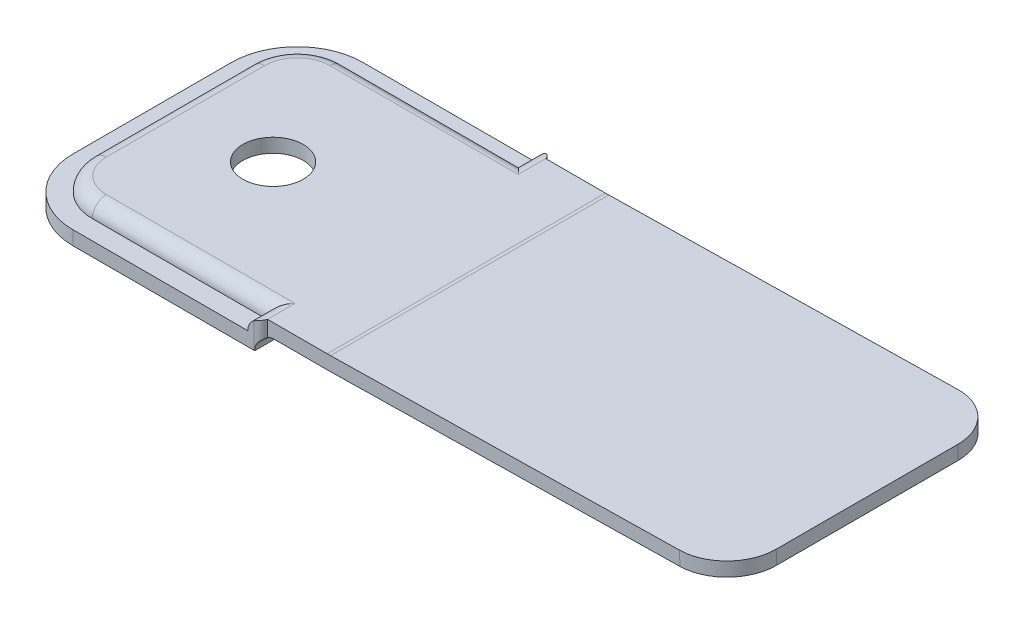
ISO-10303-21;
HEADER;
FILE_DESCRIPTION(('STEP AP214'),'2;1');
FILE_NAME('part.step','',(''),(''),'','','');
FILE_SCHEMA(('AUTOMOTIVE_DESIGN { 1 0 10303 214 1 1 1 1 }'));
ENDSEC;
DATA;
#1=APPLICATION_CONTEXT('core data for automotive mechanical design processes');
#2=APPLICATION_PROTOCOL_DEFINITION('international standard','automotive_design',2000,#1);
#3=PRODUCT_CONTEXT('',#1,'mechanical');
#4=PRODUCT('Part','Part','',(#3));
#5=PRODUCT_RELATED_PRODUCT_CATEGORY('part','',(#4));
#6=PRODUCT_DEFINITION_FORMATION('','',#4);
#7=PRODUCT_DEFINITION_CONTEXT('part definition',#1,'design');
#8=PRODUCT_DEFINITION('design','',#6,#7);
#9=PRODUCT_DEFINITION_SHAPE('','',#8);
#10=(LENGTH_UNIT() NAMED_UNIT(*) SI_UNIT(.MILLI.,.METRE.));
#11=(NAMED_UNIT(*) PLANE_ANGLE_UNIT() SI_UNIT($,.RADIAN.));
#12=(NAMED_UNIT(*) SI_UNIT($,.STERADIAN.) SOLID_ANGLE_UNIT());
#13=UNCERTAINTY_MEASURE_WITH_UNIT(LENGTH_MEASURE(1.E-05),#10,'distance_accuracy_value','');
#14=(GEOMETRIC_REPRESENTATION_CONTEXT(3) GLOBAL_UNCERTAINTY_ASSIGNED_CONTEXT((#13)) GLOBAL_UNIT_ASSIGNED_CONTEXT((#10,
#11,#12)) REPRESENTATION_CONTEXT('',''));
#15=CARTESIAN_POINT('',(0.,0.,0.));
#16=DIRECTION('',(0.,0.,1.));
#17=DIRECTION('',(1.,0.,0.));
#18=AXIS2_PLACEMENT_3D('',#15,#16,#17);
#19=CARTESIAN_POINT('',(-3.6195,0.9144,5.207));
#20=DIRECTION('',(0.,-1.,0.));
#21=DIRECTION('',(0.,0.,-1.));
#22=AXIS2_PLACEMENT_3D('',#19,#20,#21);
#23=PLANE('',#22);
#24=DIRECTION('',(0.,0.,1.));
#25=VECTOR('',#24,1.);
#26=CARTESIAN_POINT('',(7.8613,0.9144,-9.525));
#27=LINE('',#26,#25);
#28=CARTESIAN_POINT('',(7.8613,0.9144,-9.525));
#29=VERTEX_POINT('',#28);
#30=CARTESIAN_POINT('',(7.8613,0.9144,-8.255));
#31=VERTEX_POINT('',#30);
#32=EDGE_CURVE('E303',#29,#31,#27,.T.);
#33=ORIENTED_EDGE('',*,*,#32,.F.);
#34=DIRECTION('',(-1.,0.,0.));
#35=VECTOR('',#34,1.);
#36=CARTESIAN_POINT('',(8.3185,0.9144,-9.525));
#37=LINE('',#36,#35);
#38=CARTESIAN_POINT('',(-3.61949999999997,0.9144,-9.525));
#39=VERTEX_POINT('',#38);
#40=EDGE_CURVE('E338',#29,#39,#37,.T.);
#41=ORIENTED_EDGE('',*,*,#40,.T.);
#42=CARTESIAN_POINT('',(-3.6195,0.9144,-5.207));
#43=DIRECTION('',(0.,1.,0.));
#44=DIRECTION('',(0.,0.,1.));
#45=AXIS2_PLACEMENT_3D('',#42,#43,#44);
#46=CIRCLE('',#45,4.318);
#47=CARTESIAN_POINT('',(-7.9375,0.9144,-5.20699999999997));
#48=VERTEX_POINT('',#47);
#49=EDGE_CURVE('E922',#39,#48,#46,.T.);
#50=ORIENTED_EDGE('',*,*,#49,.T.);
#51=DIRECTION('',(0.,0.,1.));
#52=VECTOR('',#51,1.);
#53=CARTESIAN_POINT('',(-7.9375,0.9144,-5.20699999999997));
#54=LINE('',#53,#52);
#55=CARTESIAN_POINT('',(-7.9375,0.9144,5.20699999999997));
#56=VERTEX_POINT('',#55);
#57=EDGE_CURVE('E933',#48,#56,#54,.T.);
#58=ORIENTED_EDGE('',*,*,#57,.T.);
#59=CARTESIAN_POINT('',(-3.6195,0.9144,5.207));
#60=DIRECTION('',(0.,1.,0.));
#61=DIRECTION('',(0.,0.,-1.));
#62=AXIS2_PLACEMENT_3D('',#59,#60,#61);
#63=CIRCLE('',#62,4.318);
#64=CARTESIAN_POINT('',(-3.61949999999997,0.9144,9.525));
#65=VERTEX_POINT('',#64);
#66=EDGE_CURVE('E930',#56,#65,#63,.T.);
#67=ORIENTED_EDGE('',*,*,#66,.T.);
#68=DIRECTION('',(1.,0.,0.));
#69=VECTOR('',#68,1.);
#70=CARTESIAN_POINT('',(8.3185,0.9144,9.525));
#71=LINE('',#70,#69);
#72=CARTESIAN_POINT('',(7.8613,0.9144,9.525));
#73=VERTEX_POINT('',#72);
#74=EDGE_CURVE('E900',#65,#73,#71,.T.);
#75=ORIENTED_EDGE('',*,*,#74,.T.);
#76=CARTESIAN_POINT('',(7.8613,0.9144,8.255));
#77=VERTEX_POINT('',#76);
#78=EDGE_CURVE('E293',#77,#73,#27,.T.);
#79=ORIENTED_EDGE('',*,*,#78,.F.);
#80=DIRECTION('',(1.,0.,0.));
#81=VECTOR('',#80,1.);
#82=CARTESIAN_POINT('',(8.3185,0.9144,8.255));
#83=LINE('',#82,#81);
#84=CARTESIAN_POINT('',(-3.6195,0.9144,8.255));
#85=VERTEX_POINT('',#84);
#86=EDGE_CURVE('E335',#85,#77,#83,.T.);
#87=ORIENTED_EDGE('',*,*,#86,.F.);
#88=CARTESIAN_POINT('',(-3.6195,0.9144,5.207));
#89=DIRECTION('',(0.,1.,0.));
#90=DIRECTION('',(0.,0.,-1.));
#91=AXIS2_PLACEMENT_3D('',#88,#89,#90);
#92=CIRCLE('',#91,3.048);
#93=CARTESIAN_POINT('',(-6.6675,0.9144,5.207));
#94=VERTEX_POINT('',#93);
#95=EDGE_CURVE('E332',#94,#85,#92,.T.);
#96=ORIENTED_EDGE('',*,*,#95,.F.);
#97=DIRECTION('',(0.,0.,1.));
#98=VECTOR('',#97,1.);
#99=CARTESIAN_POINT('',(-6.6675,0.9144,5.207));
#100=LINE('',#99,#98);
#101=CARTESIAN_POINT('',(-6.6675,0.9144,-5.207));
#102=VERTEX_POINT('',#101);
#103=EDGE_CURVE('E329',#102,#94,#100,.T.);
#104=ORIENTED_EDGE('',*,*,#103,.F.);
#105=CARTESIAN_POINT('',(-3.6195,0.9144,-5.207));
#106=DIRECTION('',(0.,1.,0.));
#107=DIRECTION('',(0.,0.,-1.));
#108=AXIS2_PLACEMENT_3D('',#105,#106,#107);
#109=CIRCLE('',#108,3.048);
#110=CARTESIAN_POINT('',(-3.6195,0.9144,-8.255));
#111=VERTEX_POINT('',#110);
#112=EDGE_CURVE('E326',#111,#102,#109,.T.);
#113=ORIENTED_EDGE('',*,*,#112,.F.);
#114=DIRECTION('',(-1.,0.,0.));
#115=VECTOR('',#114,1.);
#116=CARTESIAN_POINT('',(8.3185,0.9144,-8.255));
#117=LINE('',#116,#115);
#118=EDGE_CURVE('E325',#31,#111,#117,.T.);
#119=ORIENTED_EDGE('',*,*,#118,.F.);
#120=EDGE_LOOP('',(#33,#41,#50,#58,#67,#75,#79,#87,#96,#104,#113,#119));
#121=FACE_BOUND('',#120,.T.);
#122=ADVANCED_FACE('F35',(#121),#23,.F.);
#123=CARTESIAN_POINT('',(-3.6195,0.,5.207));
#124=DIRECTION('',(0.,-1.,0.));
#125=DIRECTION('',(0.,0.,-1.));
#126=AXIS2_PLACEMENT_3D('',#123,#124,#125);
#127=PLANE('',#126);
#128=DIRECTION('',(0.,0.,-1.));
#129=VECTOR('',#128,1.);
#130=CARTESIAN_POINT('',(8.3185,0.,-9.525));
#131=LINE('',#130,#129);
#132=CARTESIAN_POINT('',(8.3185,0.,9.52381561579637));
#133=VERTEX_POINT('',#132);
#134=CARTESIAN_POINT('',(8.3185,0.,7.34059999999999));
#135=VERTEX_POINT('',#134);
#136=EDGE_CURVE('E561',#133,#135,#131,.T.);
#137=ORIENTED_EDGE('',*,*,#136,.F.);
#138=CARTESIAN_POINT('',(8.28383111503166,0.,9.017));
#139=DIRECTION('',(0.,-1.,0.));
#140=DIRECTION('',(0.,0.,-1.));
#141=AXIS2_PLACEMENT_3D('',#138,#139,#140);
#142=CIRCLE('',#141,0.508);
#143=CARTESIAN_POINT('',(8.28383111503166,0.,9.525));
#144=VERTEX_POINT('',#143);
#145=EDGE_CURVE('E546',#133,#144,#142,.T.);
#146=ORIENTED_EDGE('',*,*,#145,.T.);
#147=DIRECTION('',(1.,0.,0.));
#148=VECTOR('',#147,1.);
#149=CARTESIAN_POINT('',(8.3185,0.,9.525));
#150=LINE('',#149,#148);
#151=CARTESIAN_POINT('',(-3.61949999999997,0.,9.525));
#152=VERTEX_POINT('',#151);
#153=EDGE_CURVE('E908',#152,#144,#150,.T.);
#154=ORIENTED_EDGE('',*,*,#153,.F.);
#155=CARTESIAN_POINT('',(-3.6195,0.,5.207));
#156=DIRECTION('',(0.,1.,0.));
#157=DIRECTION('',(0.,0.,-1.));
#158=AXIS2_PLACEMENT_3D('',#155,#156,#157);
#159=CIRCLE('',#158,4.318);
#160=CARTESIAN_POINT('',(-7.9375,0.,5.20699999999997));
#161=VERTEX_POINT('',#160);
#162=EDGE_CURVE('E906',#161,#152,#159,.T.);
#163=ORIENTED_EDGE('',*,*,#162,.F.);
#164=DIRECTION('',(0.,0.,1.));
#165=VECTOR('',#164,1.);
#166=CARTESIAN_POINT('',(-7.9375,0.,-5.20699999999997));
#167=LINE('',#166,#165);
#168=CARTESIAN_POINT('',(-7.9375,0.,-5.20699999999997));
#169=VERTEX_POINT('',#168);
#170=EDGE_CURVE('E904',#169,#161,#167,.T.);
#171=ORIENTED_EDGE('',*,*,#170,.F.);
#172=CARTESIAN_POINT('',(-3.6195,0.,-5.207));
#173=DIRECTION('',(0.,1.,0.));
#174=DIRECTION('',(0.,0.,1.));
#175=AXIS2_PLACEMENT_3D('',#172,#173,#174);
#176=CIRCLE('',#175,4.318);
#177=CARTESIAN_POINT('',(-3.61949999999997,0.,-9.525));
#178=VERTEX_POINT('',#177);
#179=EDGE_CURVE('E897',#178,#169,#176,.T.);
#180=ORIENTED_EDGE('',*,*,#179,.F.);
#181=DIRECTION('',(-1.,0.,0.));
#182=VECTOR('',#181,1.);
#183=CARTESIAN_POINT('',(8.3185,0.,-9.525));
#184=LINE('',#183,#182);
#185=CARTESIAN_POINT('',(8.28383111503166,0.,-9.525));
#186=VERTEX_POINT('',#185);
#187=EDGE_CURVE('E554',#186,#178,#184,.T.);
#188=ORIENTED_EDGE('',*,*,#187,.F.);
#189=CARTESIAN_POINT('',(8.28383111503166,0.,-9.017));
#190=DIRECTION('',(0.,-1.,0.));
#191=DIRECTION('',(0.,0.,-1.));
#192=AXIS2_PLACEMENT_3D('',#189,#190,#191);
#193=CIRCLE('',#192,0.508);
#194=CARTESIAN_POINT('',(8.3185,0.,-9.52381561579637));
#195=VERTEX_POINT('',#194);
#196=EDGE_CURVE('E436',#186,#195,#193,.T.);
#197=ORIENTED_EDGE('',*,*,#196,.T.);
#198=CARTESIAN_POINT('',(8.3185,0.,-7.3406));
#199=VERTEX_POINT('',#198);
#200=EDGE_CURVE('E344',#199,#195,#131,.T.);
#201=ORIENTED_EDGE('',*,*,#200,.F.);
#202=DIRECTION('',(1.,0.,0.));
#203=VECTOR('',#202,1.);
#204=CARTESIAN_POINT('',(8.3185,0.,-7.3406));
#205=LINE('',#204,#203);
#206=CARTESIAN_POINT('',(-3.6195,0.,-7.3406));
#207=VERTEX_POINT('',#206);
#208=EDGE_CURVE('E315',#207,#199,#205,.T.);
#209=ORIENTED_EDGE('',*,*,#208,.F.);
#210=CARTESIAN_POINT('',(-3.6195,0.,-5.207));
#211=DIRECTION('',(0.,-1.,0.));
#212=DIRECTION('',(0.,0.,-1.));
#213=AXIS2_PLACEMENT_3D('',#210,#211,#212);
#214=CIRCLE('',#213,2.1336);
#215=CARTESIAN_POINT('',(-5.7531,0.,-5.207));
#216=VERTEX_POINT('',#215);
#217=EDGE_CURVE('E312',#216,#207,#214,.T.);
#218=ORIENTED_EDGE('',*,*,#217,.F.);
#219=DIRECTION('',(0.,0.,-1.));
#220=VECTOR('',#219,1.);
#221=CARTESIAN_POINT('',(-5.7531,0.,-5.207));
#222=LINE('',#221,#220);
#223=CARTESIAN_POINT('',(-5.7531,0.,5.207));
#224=VERTEX_POINT('',#223);
#225=EDGE_CURVE('E309',#224,#216,#222,.T.);
#226=ORIENTED_EDGE('',*,*,#225,.F.);
#227=CARTESIAN_POINT('',(-3.6195,0.,5.207));
#228=DIRECTION('',(0.,-1.,0.));
#229=DIRECTION('',(0.,0.,1.));
#230=AXIS2_PLACEMENT_3D('',#227,#228,#229);
#231=CIRCLE('',#230,2.1336);
#232=CARTESIAN_POINT('',(-3.6195,0.,7.34059999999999));
#233=VERTEX_POINT('',#232);
#234=EDGE_CURVE('E306',#233,#224,#231,.T.);
#235=ORIENTED_EDGE('',*,*,#234,.F.);
#236=DIRECTION('',(-1.,0.,0.));
#237=VECTOR('',#236,1.);
#238=CARTESIAN_POINT('',(-3.6195,0.,7.34059999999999));
#239=LINE('',#238,#237);
#240=EDGE_CURVE('E318',#135,#233,#239,.T.);
#241=ORIENTED_EDGE('',*,*,#240,.F.);
#242=EDGE_LOOP('',(#137,#146,#154,#163,#171,#180,#188,#197,#201,#209,#218,#226,#235,#241));
#243=FACE_BOUND('',#242,.T.);
#244=ADVANCED_FACE('F498',(#243),#127,.T.);
#245=CARTESIAN_POINT('',(8.3185,0.9144,-9.525));
#246=DIRECTION('',(0.,0.,1.));
#247=DIRECTION('',(1.,0.,0.));
#248=AXIS2_PLACEMENT_3D('',#245,#246,#247);
#249=PLANE('',#248);
#250=CARTESIAN_POINT('',(8.7757,0.9144,-9.525));
#251=DIRECTION('',(0.,0.,1.));
#252=DIRECTION('',(1.,0.,0.));
#253=AXIS2_PLACEMENT_3D('',#250,#251,#252);
#254=CIRCLE('',#253,0.9144);
#255=CARTESIAN_POINT('',(8.28383111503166,1.68523873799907,-9.525));
#256=VERTEX_POINT('',#255);
#257=EDGE_CURVE('E389',#29,#256,#254,.F.);
#258=ORIENTED_EDGE('',*,*,#257,.T.);
#259=DIRECTION('',(0.,1.,0.));
#260=VECTOR('',#259,1.);
#261=CARTESIAN_POINT('',(8.28383111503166,0.9144,-9.525));
#262=LINE('',#261,#260);
#263=EDGE_CURVE('E478',#256,#186,#262,.F.);
#264=ORIENTED_EDGE('',*,*,#263,.T.);
#265=ORIENTED_EDGE('',*,*,#187,.T.);
#266=DIRECTION('',(0.,-1.,0.));
#267=VECTOR('',#266,1.);
#268=CARTESIAN_POINT('',(-3.61949999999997,0.9144,-9.525));
#269=LINE('',#268,#267);
#270=EDGE_CURVE('E354',#39,#178,#269,.T.);
#271=ORIENTED_EDGE('',*,*,#270,.F.);
#272=ORIENTED_EDGE('',*,*,#40,.F.);
#273=EDGE_LOOP('',(#258,#264,#265,#271,#272));
#274=FACE_BOUND('',#273,.T.);
#275=ADVANCED_FACE('F504',(#274),#249,.F.);
#276=CARTESIAN_POINT('',(-3.6195,0.9144,-5.207));
#277=DIRECTION('',(0.,-1.,0.));
#278=DIRECTION('',(0.,0.,-1.));
#279=AXIS2_PLACEMENT_3D('',#276,#277,#278);
#280=CYLINDRICAL_SURFACE('',#279,4.318);
#281=ORIENTED_EDGE('',*,*,#179,.T.);
#282=DIRECTION('',(0.,-1.,0.));
#283=VECTOR('',#282,1.);
#284=CARTESIAN_POINT('',(-7.9375,0.9144,-5.20699999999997));
#285=LINE('',#284,#283);
#286=EDGE_CURVE('E916',#48,#169,#285,.T.);
#287=ORIENTED_EDGE('',*,*,#286,.F.);
#288=ORIENTED_EDGE('',*,*,#49,.F.);
#289=ORIENTED_EDGE('',*,*,#270,.T.);
#290=EDGE_LOOP('',(#281,#287,#288,#289));
#291=FACE_BOUND('',#290,.T.);
#292=ADVANCED_FACE('F522',(#291),#280,.T.);
#293=CARTESIAN_POINT('',(-7.9375,0.9144,-5.20699999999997));
#294=DIRECTION('',(1.,0.,0.));
#295=DIRECTION('',(0.,0.,-1.));
#296=AXIS2_PLACEMENT_3D('',#293,#294,#295);
#297=PLANE('',#296);
#298=ORIENTED_EDGE('',*,*,#170,.T.);
#299=DIRECTION('',(0.,-1.,0.));
#300=VECTOR('',#299,1.);
#301=CARTESIAN_POINT('',(-7.9375,0.9144,5.20699999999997));
#302=LINE('',#301,#300);
#303=EDGE_CURVE('E913',#56,#161,#302,.T.);
#304=ORIENTED_EDGE('',*,*,#303,.F.);
#305=ORIENTED_EDGE('',*,*,#57,.F.);
#306=ORIENTED_EDGE('',*,*,#286,.T.);
#307=EDGE_LOOP('',(#298,#304,#305,#306));
#308=FACE_BOUND('',#307,.T.);
#309=ADVANCED_FACE('F518',(#308),#297,.F.);
#310=CARTESIAN_POINT('',(-3.6195,0.9144,5.207));
#311=DIRECTION('',(0.,-1.,0.));
#312=DIRECTION('',(0.,0.,-1.));
#313=AXIS2_PLACEMENT_3D('',#310,#311,#312);
#314=CYLINDRICAL_SURFACE('',#313,4.318);
#315=ORIENTED_EDGE('',*,*,#162,.T.);
#316=DIRECTION('',(0.,-1.,0.));
#317=VECTOR('',#316,1.);
#318=CARTESIAN_POINT('',(-3.61949999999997,0.9144,9.525));
#319=LINE('',#318,#317);
#320=EDGE_CURVE('E910',#65,#152,#319,.T.);
#321=ORIENTED_EDGE('',*,*,#320,.F.);
#322=ORIENTED_EDGE('',*,*,#66,.F.);
#323=ORIENTED_EDGE('',*,*,#303,.T.);
#324=EDGE_LOOP('',(#315,#321,#322,#323));
#325=FACE_BOUND('',#324,.T.);
#326=ADVANCED_FACE('F514',(#325),#314,.T.);
#327=CARTESIAN_POINT('',(8.3185,0.9144,9.525));
#328=DIRECTION('',(0.,0.,-1.));
#329=DIRECTION('',(-1.,0.,0.));
#330=AXIS2_PLACEMENT_3D('',#327,#328,#329);
#331=PLANE('',#330);
#332=ORIENTED_EDGE('',*,*,#153,.T.);
#333=DIRECTION('',(0.,1.,0.));
#334=VECTOR('',#333,1.);
#335=CARTESIAN_POINT('',(8.28383111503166,0.9144,9.525));
#336=LINE('',#335,#334);
#337=CARTESIAN_POINT('',(8.28383111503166,1.68523873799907,9.525));
#338=VERTEX_POINT('',#337);
#339=EDGE_CURVE('E545',#144,#338,#336,.T.);
#340=ORIENTED_EDGE('',*,*,#339,.T.);
#341=CARTESIAN_POINT('',(8.7757,0.9144,9.525));
#342=DIRECTION('',(0.,0.,-1.));
#343=DIRECTION('',(-1.,0.,0.));
#344=AXIS2_PLACEMENT_3D('',#341,#342,#343);
#345=CIRCLE('',#344,0.9144);
#346=EDGE_CURVE('E387',#338,#73,#345,.F.);
#347=ORIENTED_EDGE('',*,*,#346,.T.);
#348=ORIENTED_EDGE('',*,*,#74,.F.);
#349=ORIENTED_EDGE('',*,*,#320,.T.);
#350=EDGE_LOOP('',(#332,#340,#347,#348,#349));
#351=FACE_BOUND('',#350,.T.);
#352=ADVANCED_FACE('F511',(#351),#331,.F.);
#353=CARTESIAN_POINT('',(0.,0.9144,0.));
#354=DIRECTION('',(0.,-1.,0.));
#355=DIRECTION('',(0.,0.,-1.));
#356=AXIS2_PLACEMENT_3D('',#353,#354,#355);
#357=CYLINDRICAL_SURFACE('',#356,1.984375);
#358=CARTESIAN_POINT('',(0.,0.9144,0.));
#359=DIRECTION('',(0.,1.,0.));
#360=DIRECTION('',(0.,0.,1.));
#361=AXIS2_PLACEMENT_3D('',#358,#359,#360);
#362=CIRCLE('',#361,1.984375);
#363=CARTESIAN_POINT('',(0.,0.9144,1.984375));
#364=VERTEX_POINT('',#363);
#365=EDGE_CURVE('E321',#364,#364,#362,.T.);
#366=ORIENTED_EDGE('',*,*,#365,.F.);
#367=EDGE_LOOP('',(#366));
#368=FACE_BOUND('',#367,.T.);
#369=CARTESIAN_POINT('',(0.,1.8288,0.));
#370=DIRECTION('',(0.,1.,0.));
#371=DIRECTION('',(0.,0.,1.));
#372=AXIS2_PLACEMENT_3D('',#369,#370,#371);
#373=CIRCLE('',#372,1.984375);
#374=CARTESIAN_POINT('',(0.,1.8288,1.984375));
#375=VERTEX_POINT('',#374);
#376=EDGE_CURVE('E322',#375,#375,#373,.T.);
#377=ORIENTED_EDGE('',*,*,#376,.T.);
#378=EDGE_LOOP('',(#377));
#379=FACE_BOUND('',#378,.T.);
#380=ADVANCED_FACE('F508',(#368,#379),#357,.F.);
#381=CARTESIAN_POINT('',(-3.6195,1.8288,-5.207));
#382=DIRECTION('',(0.,-1.,0.));
#383=DIRECTION('',(0.,0.,-1.));
#384=AXIS2_PLACEMENT_3D('',#381,#382,#383);
#385=PLANE('',#384);
#386=DIRECTION('',(1.,0.,0.));
#387=VECTOR('',#386,1.);
#388=CARTESIAN_POINT('',(-3.6195,1.8288,7.34059999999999));
#389=LINE('',#388,#387);
#390=CARTESIAN_POINT('',(-3.6195,1.8288,7.3406));
#391=VERTEX_POINT('',#390);
#392=CARTESIAN_POINT('',(8.7757,1.8288,7.3406));
#393=VERTEX_POINT('',#392);
#394=EDGE_CURVE('E367',#391,#393,#389,.T.);
#395=ORIENTED_EDGE('',*,*,#394,.T.);
#396=DIRECTION('',(0.,0.,1.));
#397=VECTOR('',#396,1.);
#398=CARTESIAN_POINT('',(8.7757,1.8288,-5.207));
#399=LINE('',#398,#397);
#400=CARTESIAN_POINT('',(8.7757,1.8288,9.144));
#401=VERTEX_POINT('',#400);
#402=EDGE_CURVE('E370',#393,#401,#399,.T.);
#403=ORIENTED_EDGE('',*,*,#402,.T.);
#404=DIRECTION('',(1.,0.,0.));
#405=VECTOR('',#404,1.);
#406=CARTESIAN_POINT('',(12.7,1.8288,9.144));
#407=LINE('',#406,#405);
#408=CARTESIAN_POINT('',(12.7,1.8288,9.144));
#409=VERTEX_POINT('',#408);
#410=EDGE_CURVE('E264',#401,#409,#407,.T.);
#411=ORIENTED_EDGE('',*,*,#410,.T.);
#412=DIRECTION('',(0.,0.,-1.));
#413=VECTOR('',#412,1.);
#414=CARTESIAN_POINT('',(12.7,1.8288,9.144));
#415=LINE('',#414,#413);
#416=CARTESIAN_POINT('',(12.7,1.8288,-9.144));
#417=VERTEX_POINT('',#416);
#418=EDGE_CURVE('E255',#409,#417,#415,.T.);
#419=ORIENTED_EDGE('',*,*,#418,.T.);
#420=DIRECTION('',(1.,0.,0.));
#421=VECTOR('',#420,1.);
#422=CARTESIAN_POINT('',(12.7,1.8288,-9.144));
#423=LINE('',#422,#421);
#424=CARTESIAN_POINT('',(8.7757,1.8288,-9.144));
#425=VERTEX_POINT('',#424);
#426=EDGE_CURVE('E286',#425,#417,#423,.T.);
#427=ORIENTED_EDGE('',*,*,#426,.F.);
#428=DIRECTION('',(0.,0.,1.));
#429=VECTOR('',#428,1.);
#430=CARTESIAN_POINT('',(8.7757,1.8288,-5.207));
#431=LINE('',#430,#429);
#432=CARTESIAN_POINT('',(8.7757,1.8288,-7.3406));
#433=VERTEX_POINT('',#432);
#434=EDGE_CURVE('E357',#425,#433,#431,.T.);
#435=ORIENTED_EDGE('',*,*,#434,.T.);
#436=DIRECTION('',(-1.,0.,0.));
#437=VECTOR('',#436,1.);
#438=CARTESIAN_POINT('',(-3.6195,1.8288,-7.3406));
#439=LINE('',#438,#437);
#440=CARTESIAN_POINT('',(-3.6195,1.8288,-7.3406));
#441=VERTEX_POINT('',#440);
#442=EDGE_CURVE('E359',#433,#441,#439,.T.);
#443=ORIENTED_EDGE('',*,*,#442,.T.);
#444=CARTESIAN_POINT('',(-3.6195,1.8288,-5.207));
#445=DIRECTION('',(0.,-1.,0.));
#446=DIRECTION('',(0.,0.,-1.));
#447=AXIS2_PLACEMENT_3D('',#444,#445,#446);
#448=CIRCLE('',#447,2.1336);
#449=CARTESIAN_POINT('',(-5.7531,1.8288,-5.207));
#450=VERTEX_POINT('',#449);
#451=EDGE_CURVE('E361',#441,#450,#448,.F.);
#452=ORIENTED_EDGE('',*,*,#451,.T.);
#453=DIRECTION('',(0.,0.,1.));
#454=VECTOR('',#453,1.);
#455=CARTESIAN_POINT('',(-5.7531,1.8288,-5.207));
#456=LINE('',#455,#454);
#457=CARTESIAN_POINT('',(-5.7531,1.8288,5.207));
#458=VERTEX_POINT('',#457);
#459=EDGE_CURVE('E363',#450,#458,#456,.T.);
#460=ORIENTED_EDGE('',*,*,#459,.T.);
#461=CARTESIAN_POINT('',(-3.6195,1.8288,5.207));
#462=DIRECTION('',(0.,-1.,0.));
#463=DIRECTION('',(0.,0.,-1.));
#464=AXIS2_PLACEMENT_3D('',#461,#462,#463);
#465=CIRCLE('',#464,2.1336);
#466=EDGE_CURVE('E365',#458,#391,#465,.F.);
#467=ORIENTED_EDGE('',*,*,#466,.T.);
#468=EDGE_LOOP('',(#395,#403,#411,#419,#427,#435,#443,#452,#460,#467));
#469=FACE_BOUND('',#468,.T.);
#470=ORIENTED_EDGE('',*,*,#376,.F.);
#471=EDGE_LOOP('',(#470));
#472=FACE_BOUND('',#471,.T.);
#473=ADVANCED_FACE('F570',(#469,#472),#385,.F.);
#474=CARTESIAN_POINT('',(-3.6195,0.9144,5.207));
#475=DIRECTION('',(0.,1.,0.));
#476=DIRECTION('',(0.,0.,1.));
#477=AXIS2_PLACEMENT_3D('',#474,#475,#476);
#478=PLANE('',#477);
#479=DIRECTION('',(1.,0.,0.));
#480=VECTOR('',#479,1.);
#481=CARTESIAN_POINT('',(8.3185,0.9144,-6.4262));
#482=LINE('',#481,#480);
#483=CARTESIAN_POINT('',(-3.6195,0.9144,-6.4262));
#484=VERTEX_POINT('',#483);
#485=CARTESIAN_POINT('',(9.2329,0.9144,-6.4262));
#486=VERTEX_POINT('',#485);
#487=EDGE_CURVE('E383',#484,#486,#482,.T.);
#488=ORIENTED_EDGE('',*,*,#487,.T.);
#489=DIRECTION('',(0.,0.,-1.));
#490=VECTOR('',#489,1.);
#491=CARTESIAN_POINT('',(9.2329,0.9144,-9.525));
#492=LINE('',#491,#490);
#493=CARTESIAN_POINT('',(9.2329,0.9144,-9.144));
#494=VERTEX_POINT('',#493);
#495=EDGE_CURVE('E385',#486,#494,#492,.T.);
#496=ORIENTED_EDGE('',*,*,#495,.T.);
#497=DIRECTION('',(-1.,0.,0.));
#498=VECTOR('',#497,1.);
#499=CARTESIAN_POINT('',(8.3185,0.9144,-9.144));
#500=LINE('',#499,#498);
#501=CARTESIAN_POINT('',(12.7,0.914399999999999,-9.144));
#502=VERTEX_POINT('',#501);
#503=EDGE_CURVE('E250',#502,#494,#500,.T.);
#504=ORIENTED_EDGE('',*,*,#503,.F.);
#505=DIRECTION('',(0.,0.,-1.));
#506=VECTOR('',#505,1.);
#507=CARTESIAN_POINT('',(12.7,0.914399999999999,9.144));
#508=LINE('',#507,#506);
#509=CARTESIAN_POINT('',(12.7,0.914399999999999,9.144));
#510=VERTEX_POINT('',#509);
#511=EDGE_CURVE('E242',#510,#502,#508,.T.);
#512=ORIENTED_EDGE('',*,*,#511,.F.);
#513=DIRECTION('',(-1.,0.,0.));
#514=VECTOR('',#513,1.);
#515=CARTESIAN_POINT('',(8.3185,0.9144,9.144));
#516=LINE('',#515,#514);
#517=CARTESIAN_POINT('',(9.2329,0.9144,9.144));
#518=VERTEX_POINT('',#517);
#519=EDGE_CURVE('E247',#510,#518,#516,.T.);
#520=ORIENTED_EDGE('',*,*,#519,.T.);
#521=DIRECTION('',(0.,0.,-1.));
#522=VECTOR('',#521,1.);
#523=CARTESIAN_POINT('',(9.2329,0.9144,7.34059999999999));
#524=LINE('',#523,#522);
#525=CARTESIAN_POINT('',(9.2329,0.9144,6.42619999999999));
#526=VERTEX_POINT('',#525);
#527=EDGE_CURVE('E375',#518,#526,#524,.T.);
#528=ORIENTED_EDGE('',*,*,#527,.T.);
#529=DIRECTION('',(-1.,0.,0.));
#530=VECTOR('',#529,1.);
#531=CARTESIAN_POINT('',(-3.6195,0.9144,6.42619999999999));
#532=LINE('',#531,#530);
#533=CARTESIAN_POINT('',(-3.6195,0.9144,6.42619999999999));
#534=VERTEX_POINT('',#533);
#535=EDGE_CURVE('E373',#526,#534,#532,.T.);
#536=ORIENTED_EDGE('',*,*,#535,.T.);
#537=CARTESIAN_POINT('',(-3.6195,0.9144,5.207));
#538=DIRECTION('',(0.,1.,0.));
#539=DIRECTION('',(0.,0.,1.));
#540=AXIS2_PLACEMENT_3D('',#537,#538,#539);
#541=CIRCLE('',#540,1.2192);
#542=CARTESIAN_POINT('',(-4.8387,0.9144,5.207));
#543=VERTEX_POINT('',#542);
#544=EDGE_CURVE('E377',#534,#543,#541,.F.);
#545=ORIENTED_EDGE('',*,*,#544,.T.);
#546=DIRECTION('',(0.,0.,-1.));
#547=VECTOR('',#546,1.);
#548=CARTESIAN_POINT('',(-4.8387,0.9144,-5.207));
#549=LINE('',#548,#547);
#550=CARTESIAN_POINT('',(-4.8387,0.9144,-5.207));
#551=VERTEX_POINT('',#550);
#552=EDGE_CURVE('E379',#543,#551,#549,.T.);
#553=ORIENTED_EDGE('',*,*,#552,.T.);
#554=CARTESIAN_POINT('',(-3.6195,0.9144,-5.207));
#555=DIRECTION('',(0.,1.,0.));
#556=DIRECTION('',(0.,0.,1.));
#557=AXIS2_PLACEMENT_3D('',#554,#555,#556);
#558=CIRCLE('',#557,1.2192);
#559=EDGE_CURVE('E381',#551,#484,#558,.F.);
#560=ORIENTED_EDGE('',*,*,#559,.T.);
#561=EDGE_LOOP('',(#488,#496,#504,#512,#520,#528,#536,#545,#553,#560));
#562=FACE_BOUND('',#561,.T.);
#563=ORIENTED_EDGE('',*,*,#365,.T.);
#564=EDGE_LOOP('',(#563));
#565=FACE_BOUND('',#564,.T.);
#566=ADVANCED_FACE('F245',(#562,#565),#478,.F.);
#567=CARTESIAN_POINT('',(12.7,14.5288,9.144));
#568=DIRECTION('',(0.,0.,1.));
#569=DIRECTION('',(1.,0.,0.));
#570=AXIS2_PLACEMENT_3D('',#567,#568,#569);
#571=PLANE('',#570);
#572=DIRECTION('',(-0.999848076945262,-0.0174305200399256,0.));
#573=VECTOR('',#572,1.);
#574=CARTESIAN_POINT('',(12.9373060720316,0.916468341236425,9.144));
#575=LINE('',#574,#573);
#576=CARTESIAN_POINT('',(35.8779823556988,1.31639701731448,9.144));
#577=VERTEX_POINT('',#576);
#578=CARTESIAN_POINT('',(12.9373060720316,0.916468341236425,9.144));
#579=VERTEX_POINT('',#578);
#580=EDGE_CURVE('E256',#577,#579,#575,.T.);
#581=ORIENTED_EDGE('',*,*,#580,.F.);
#582=DIRECTION('',(0.0174305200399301,-0.999848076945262,0.));
#583=VECTOR('',#582,1.);
#584=CARTESIAN_POINT('',(35.6406762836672,14.9287286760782,9.144));
#585=LINE('',#584,#583);
#586=CARTESIAN_POINT('',(35.8620438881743,2.23065809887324,9.144));
#587=VERTEX_POINT('',#586);
#588=EDGE_CURVE('E58',#577,#587,#585,.F.);
#589=ORIENTED_EDGE('',*,*,#588,.T.);
#590=DIRECTION('',(0.999848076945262,0.0174305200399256,0.));
#591=VECTOR('',#590,1.);
#592=CARTESIAN_POINT('',(39.0365615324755,2.286,9.144));
#593=LINE('',#592,#591);
#594=CARTESIAN_POINT('',(12.9213676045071,1.83072942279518,9.144));
#595=VERTEX_POINT('',#594);
#596=EDGE_CURVE('E279',#595,#587,#593,.T.);
#597=ORIENTED_EDGE('',*,*,#596,.F.);
#598=CARTESIAN_POINT('',(12.7,14.5288,9.144));
#599=DIRECTION('',(0.,0.,1.));
#600=DIRECTION('',(1.,0.,0.));
#601=AXIS2_PLACEMENT_3D('',#598,#599,#600);
#602=CIRCLE('',#601,12.7);
#603=EDGE_CURVE('E276',#409,#595,#602,.T.);
#604=ORIENTED_EDGE('',*,*,#603,.F.);
#605=ORIENTED_EDGE('',*,*,#410,.F.);
#606=DIRECTION('',(0.,1.,0.));
#607=VECTOR('',#606,1.);
#608=CARTESIAN_POINT('',(8.7757,1.8288,9.144));
#609=LINE('',#608,#607);
#610=CARTESIAN_POINT('',(8.7757,0.791893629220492,9.144));
#611=VERTEX_POINT('',#610);
#612=EDGE_CURVE('E353',#611,#401,#609,.T.);
#613=ORIENTED_EDGE('',*,*,#612,.F.);
#614=CARTESIAN_POINT('',(9.2329,0.,9.144));
#615=DIRECTION('',(0.,0.,1.));
#616=DIRECTION('',(1.,0.,0.));
#617=AXIS2_PLACEMENT_3D('',#614,#615,#616);
#618=CIRCLE('',#617,0.9144);
#619=EDGE_CURVE('E263',#611,#518,#618,.F.);
#620=ORIENTED_EDGE('',*,*,#619,.T.);
#621=ORIENTED_EDGE('',*,*,#519,.F.);
#622=CARTESIAN_POINT('',(12.7,14.5288,9.144));
#623=DIRECTION('',(0.,0.,-1.));
#624=DIRECTION('',(1.,0.,0.));
#625=AXIS2_PLACEMENT_3D('',#622,#623,#624);
#626=CIRCLE('',#625,13.6144);
#627=EDGE_CURVE('E260',#579,#510,#626,.T.);
#628=ORIENTED_EDGE('',*,*,#627,.F.);
#629=EDGE_LOOP('',(#581,#589,#597,#604,#605,#613,#620,#621,#628));
#630=FACE_BOUND('',#629,.T.);
#631=ADVANCED_FACE('F259',(#630),#571,.T.);
#632=CARTESIAN_POINT('',(12.7,14.5288,-9.144));
#633=DIRECTION('',(0.,0.,1.));
#634=DIRECTION('',(1.,0.,0.));
#635=AXIS2_PLACEMENT_3D('',#632,#633,#634);
#636=PLANE('',#635);
#637=DIRECTION('',(0.999848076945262,0.0174305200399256,0.));
#638=VECTOR('',#637,1.);
#639=CARTESIAN_POINT('',(39.0365615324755,2.286,-9.144));
#640=LINE('',#639,#638);
#641=CARTESIAN_POINT('',(12.9213676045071,1.83072942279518,-9.144));
#642=VERTEX_POINT('',#641);
#643=CARTESIAN_POINT('',(35.8620438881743,2.23065809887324,-9.144));
#644=VERTEX_POINT('',#643);
#645=EDGE_CURVE('E272',#642,#644,#640,.T.);
#646=ORIENTED_EDGE('',*,*,#645,.T.);
#647=DIRECTION('',(0.0174305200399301,-0.999848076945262,0.));
#648=VECTOR('',#647,1.);
#649=CARTESIAN_POINT('',(35.8779823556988,1.31639701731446,-9.144));
#650=LINE('',#649,#648);
#651=CARTESIAN_POINT('',(35.8779823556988,1.31639701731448,-9.144));
#652=VERTEX_POINT('',#651);
#653=EDGE_CURVE('E11',#644,#652,#650,.T.);
#654=ORIENTED_EDGE('',*,*,#653,.T.);
#655=DIRECTION('',(-0.999848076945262,-0.0174305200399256,0.));
#656=VECTOR('',#655,1.);
#657=CARTESIAN_POINT('',(12.9373060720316,0.916468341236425,-9.144));
#658=LINE('',#657,#656);
#659=CARTESIAN_POINT('',(12.9373060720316,0.916468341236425,-9.144));
#660=VERTEX_POINT('',#659);
#661=EDGE_CURVE('E270',#652,#660,#658,.T.);
#662=ORIENTED_EDGE('',*,*,#661,.T.);
#663=CARTESIAN_POINT('',(12.7,14.5288,-9.144));
#664=DIRECTION('',(0.,0.,-1.));
#665=DIRECTION('',(1.,0.,0.));
#666=AXIS2_PLACEMENT_3D('',#663,#664,#665);
#667=CIRCLE('',#666,13.6144);
#668=EDGE_CURVE('E282',#660,#502,#667,.T.);
#669=ORIENTED_EDGE('',*,*,#668,.T.);
#670=ORIENTED_EDGE('',*,*,#503,.T.);
#671=CARTESIAN_POINT('',(9.2329,0.,-9.144));
#672=DIRECTION('',(0.,0.,1.));
#673=DIRECTION('',(1.,0.,0.));
#674=AXIS2_PLACEMENT_3D('',#671,#672,#673);
#675=CIRCLE('',#674,0.9144);
#676=CARTESIAN_POINT('',(8.7757,0.791893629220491,-9.144));
#677=VERTEX_POINT('',#676);
#678=EDGE_CURVE('E393',#494,#677,#675,.T.);
#679=ORIENTED_EDGE('',*,*,#678,.T.);
#680=DIRECTION('',(0.,1.,0.));
#681=VECTOR('',#680,1.);
#682=CARTESIAN_POINT('',(8.7757,1.8288,-9.144));
#683=LINE('',#682,#681);
#684=EDGE_CURVE('E351',#677,#425,#683,.T.);
#685=ORIENTED_EDGE('',*,*,#684,.T.);
#686=ORIENTED_EDGE('',*,*,#426,.T.);
#687=CARTESIAN_POINT('',(12.7,14.5288,-9.144));
#688=DIRECTION('',(0.,0.,1.));
#689=DIRECTION('',(1.,0.,0.));
#690=AXIS2_PLACEMENT_3D('',#687,#688,#689);
#691=CIRCLE('',#690,12.7);
#692=EDGE_CURVE('E288',#417,#642,#691,.T.);
#693=ORIENTED_EDGE('',*,*,#692,.T.);
#694=EDGE_LOOP('',(#646,#654,#662,#669,#670,#679,#685,#686,#693));
#695=FACE_BOUND('',#694,.T.);
#696=ADVANCED_FACE('F567',(#695),#636,.F.);
#697=CARTESIAN_POINT('',(12.7,14.5288,9.144));
#698=DIRECTION('',(0.,0.,-1.));
#699=DIRECTION('',(-1.,0.,0.));
#700=AXIS2_PLACEMENT_3D('',#697,#698,#699);
#701=CYLINDRICAL_SURFACE('',#700,13.6144);
#702=ORIENTED_EDGE('',*,*,#668,.F.);
#703=DIRECTION('',(0.,0.,-1.));
#704=VECTOR('',#703,1.);
#705=CARTESIAN_POINT('',(12.9373060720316,0.916468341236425,9.144));
#706=LINE('',#705,#704);
#707=EDGE_CURVE('E269',#579,#660,#706,.T.);
#708=ORIENTED_EDGE('',*,*,#707,.F.);
#709=ORIENTED_EDGE('',*,*,#627,.T.);
#710=ORIENTED_EDGE('',*,*,#511,.T.);
#711=EDGE_LOOP('',(#702,#708,#709,#710));
#712=FACE_BOUND('',#711,.T.);
#713=ADVANCED_FACE('F267',(#712),#701,.T.);
#714=CARTESIAN_POINT('',(12.9373060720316,0.916468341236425,9.144));
#715=DIRECTION('',(0.0174305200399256,-0.999848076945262,0.));
#716=DIRECTION('',(0.999848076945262,0.0174305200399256,0.));
#717=AXIS2_PLACEMENT_3D('',#714,#715,#716);
#718=PLANE('',#717);
#719=DIRECTION('',(0.,0.,-1.));
#720=VECTOR('',#719,1.);
#721=CARTESIAN_POINT('',(39.0525,1.37173891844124,9.144));
#722=LINE('',#721,#720);
#723=CARTESIAN_POINT('',(39.0525,1.37173891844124,5.969));
#724=VERTEX_POINT('',#723);
#725=CARTESIAN_POINT('',(39.0525,1.37173891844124,-5.969));
#726=VERTEX_POINT('',#725);
#727=EDGE_CURVE('E294',#724,#726,#722,.T.);
#728=ORIENTED_EDGE('',*,*,#727,.F.);
#729=CARTESIAN_POINT('',(35.8779823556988,1.31639701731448,5.969));
#730=DIRECTION('',(0.0174305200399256,-0.999848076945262,0.));
#731=DIRECTION('',(0.999848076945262,0.0174305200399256,0.));
#732=AXIS2_PLACEMENT_3D('',#729,#730,#731);
#733=CIRCLE('',#732,3.175);
#734=EDGE_CURVE('E620',#724,#577,#733,.T.);
#735=ORIENTED_EDGE('',*,*,#734,.T.);
#736=ORIENTED_EDGE('',*,*,#580,.T.);
#737=ORIENTED_EDGE('',*,*,#707,.T.);
#738=ORIENTED_EDGE('',*,*,#661,.F.);
#739=CARTESIAN_POINT('',(35.8779823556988,1.31639701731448,-5.969));
#740=DIRECTION('',(0.0174305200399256,-0.999848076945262,0.));
#741=DIRECTION('',(0.999848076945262,0.0174305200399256,0.));
#742=AXIS2_PLACEMENT_3D('',#739,#740,#741);
#743=CIRCLE('',#742,3.175);
#744=EDGE_CURVE('E625',#652,#726,#743,.T.);
#745=ORIENTED_EDGE('',*,*,#744,.T.);
#746=EDGE_LOOP('',(#728,#735,#736,#737,#738,#745));
#747=FACE_BOUND('',#746,.T.);
#748=ADVANCED_FACE('F619',(#747),#718,.T.);
#749=CARTESIAN_POINT('',(39.0525,1.37173891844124,9.144));
#750=DIRECTION('',(0.999848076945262,0.0174305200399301,0.));
#751=DIRECTION('',(-0.0174305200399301,0.999848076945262,0.));
#752=AXIS2_PLACEMENT_3D('',#749,#750,#751);
#753=PLANE('',#752);
#754=DIRECTION('',(0.,0.,-1.));
#755=VECTOR('',#754,1.);
#756=CARTESIAN_POINT('',(39.0365615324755,2.286,9.144));
#757=LINE('',#756,#755);
#758=CARTESIAN_POINT('',(39.0365615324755,2.286,5.969));
#759=VERTEX_POINT('',#758);
#760=CARTESIAN_POINT('',(39.0365615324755,2.286,-5.969));
#761=VERTEX_POINT('',#760);
#762=EDGE_CURVE('E297',#759,#761,#757,.T.);
#763=ORIENTED_EDGE('',*,*,#762,.F.);
#764=DIRECTION('',(0.0174305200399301,-0.999848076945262,0.));
#765=VECTOR('',#764,1.);
#766=CARTESIAN_POINT('',(39.0525,1.37173891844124,5.969));
#767=LINE('',#766,#765);
#768=EDGE_CURVE('E632',#759,#724,#767,.T.);
#769=ORIENTED_EDGE('',*,*,#768,.T.);
#770=ORIENTED_EDGE('',*,*,#727,.T.);
#771=DIRECTION('',(0.0174305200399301,-0.999848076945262,0.));
#772=VECTOR('',#771,1.);
#773=CARTESIAN_POINT('',(39.0365615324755,2.286,-5.969));
#774=LINE('',#773,#772);
#775=EDGE_CURVE('E634',#726,#761,#774,.F.);
#776=ORIENTED_EDGE('',*,*,#775,.T.);
#777=EDGE_LOOP('',(#763,#769,#770,#776));
#778=FACE_BOUND('',#777,.T.);
#779=ADVANCED_FACE('F631',(#778),#753,.T.);
#780=CARTESIAN_POINT('',(39.0365615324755,2.286,9.144));
#781=DIRECTION('',(-0.0174305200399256,0.999848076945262,0.));
#782=DIRECTION('',(-0.999848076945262,-0.0174305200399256,0.));
#783=AXIS2_PLACEMENT_3D('',#780,#781,#782);
#784=PLANE('',#783);
#785=ORIENTED_EDGE('',*,*,#596,.T.);
#786=CARTESIAN_POINT('',(35.8620438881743,2.23065809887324,5.969));
#787=DIRECTION('',(-0.0174305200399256,0.999848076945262,0.));
#788=DIRECTION('',(-0.999848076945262,-0.0174305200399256,0.));
#789=AXIS2_PLACEMENT_3D('',#786,#787,#788);
#790=CIRCLE('',#789,3.175);
#791=EDGE_CURVE('E43',#587,#759,#790,.T.);
#792=ORIENTED_EDGE('',*,*,#791,.T.);
#793=ORIENTED_EDGE('',*,*,#762,.T.);
#794=CARTESIAN_POINT('',(35.8620438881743,2.23065809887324,-5.969));
#795=DIRECTION('',(-0.0174305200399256,0.999848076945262,0.));
#796=DIRECTION('',(-0.999848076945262,-0.0174305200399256,0.));
#797=AXIS2_PLACEMENT_3D('',#794,#795,#796);
#798=CIRCLE('',#797,3.175);
#799=EDGE_CURVE('E50',#761,#644,#798,.T.);
#800=ORIENTED_EDGE('',*,*,#799,.T.);
#801=ORIENTED_EDGE('',*,*,#645,.F.);
#802=DIRECTION('',(0.,0.,-1.));
#803=VECTOR('',#802,1.);
#804=CARTESIAN_POINT('',(12.9213676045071,1.83072942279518,9.144));
#805=LINE('',#804,#803);
#806=EDGE_CURVE('E299',#595,#642,#805,.T.);
#807=ORIENTED_EDGE('',*,*,#806,.F.);
#808=EDGE_LOOP('',(#785,#792,#793,#800,#801,#807));
#809=FACE_BOUND('',#808,.T.);
#810=ADVANCED_FACE('F629',(#809),#784,.T.);
#811=CARTESIAN_POINT('',(12.7,14.5288,9.144));
#812=DIRECTION('',(0.,0.,-1.));
#813=DIRECTION('',(-1.,0.,0.));
#814=AXIS2_PLACEMENT_3D('',#811,#812,#813);
#815=CYLINDRICAL_SURFACE('',#814,12.7);
#816=ORIENTED_EDGE('',*,*,#692,.F.);
#817=ORIENTED_EDGE('',*,*,#418,.F.);
#818=ORIENTED_EDGE('',*,*,#603,.T.);
#819=ORIENTED_EDGE('',*,*,#806,.T.);
#820=EDGE_LOOP('',(#816,#817,#818,#819));
#821=FACE_BOUND('',#820,.T.);
#822=ADVANCED_FACE('F642',(#821),#815,.F.);
#823=CARTESIAN_POINT('',(8.7757,0.9144,-5.207));
#824=DIRECTION('',(0.,0.,1.));
#825=DIRECTION('',(1.,0.,0.));
#826=AXIS2_PLACEMENT_3D('',#823,#824,#825);
#827=CYLINDRICAL_SURFACE('',#826,0.9144);
#828=ORIENTED_EDGE('',*,*,#434,.F.);
#829=CARTESIAN_POINT('',(8.7757,1.8288,-9.144));
#830=CARTESIAN_POINT('',(8.76870776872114,1.8287763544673,-9.17118257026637));
#831=CARTESIAN_POINT('',(8.75941482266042,1.82872011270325,-9.19777306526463));
#832=CARTESIAN_POINT('',(8.73657747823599,1.82804035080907,-9.24909405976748));
#833=CARTESIAN_POINT('',(8.72302758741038,1.8274160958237,-9.27382210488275));
#834=CARTESIAN_POINT('',(8.69202389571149,1.8250939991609,-9.3207021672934));
#835=CARTESIAN_POINT('',(8.67456446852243,1.82339460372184,-9.34285040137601));
#836=CARTESIAN_POINT('',(8.63635730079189,1.81832559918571,-9.38384091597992));
#837=CARTESIAN_POINT('',(8.61561364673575,1.81495805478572,-9.40268724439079));
#838=CARTESIAN_POINT('',(8.57234633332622,1.80616485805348,-9.43597885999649));
#839=CARTESIAN_POINT('',(8.5499045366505,1.80081117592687,-9.45054939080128));
#840=CARTESIAN_POINT('',(8.50356375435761,1.78769716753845,-9.47577816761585));
#841=CARTESIAN_POINT('',(8.4796644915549,1.77993638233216,-9.48643566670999));
#842=CARTESIAN_POINT('',(8.43230947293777,1.76223592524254,-9.50344418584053));
#843=CARTESIAN_POINT('',(8.40887117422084,1.75238985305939,-9.50994295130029));
#844=CARTESIAN_POINT('',(8.36237322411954,1.73045569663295,-9.51945159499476));
#845=CARTESIAN_POINT('',(8.3393132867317,1.71836939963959,-9.52246424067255));
#846=CARTESIAN_POINT('',(8.3056452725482,1.69883895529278,-9.52465480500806));
#847=CARTESIAN_POINT('',(8.29465849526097,1.69215278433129,-9.52500302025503));
#848=CARTESIAN_POINT('',(8.28383111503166,1.68523873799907,-9.525));
#849=B_SPLINE_CURVE_WITH_KNOTS('',3,(#829,#830,#831,#832,#833,#834,#835,#836,#837,#838,#839,
#840,#841,#842,#843,#844,#845,#846,#847,#848),.UNSPECIFIED.,.F.,.F.,(4,2,2,2,2,2,2,2,2,4),(0.,
0.0841089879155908,0.168326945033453,0.252666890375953,0.336902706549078,0.418344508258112,
0.499801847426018,0.578175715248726,0.656487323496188,0.695045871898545),.UNSPECIFIED.);
#850=EDGE_CURVE('E477',#425,#256,#849,.T.);
#851=ORIENTED_EDGE('',*,*,#850,.T.);
#852=ORIENTED_EDGE('',*,*,#257,.F.);
#853=ORIENTED_EDGE('',*,*,#32,.T.);
#854=CARTESIAN_POINT('',(8.7757,0.9144,-7.3406));
#855=DIRECTION('',(-0.707106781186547,0.,0.707106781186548));
#856=DIRECTION('',(-0.707106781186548,0.,-0.707106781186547));
#857=AXIS2_PLACEMENT_3D('',#854,#855,#856);
#858=ELLIPSE('',#857,1.29315688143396,0.9144);
#859=EDGE_CURVE('E284',#433,#31,#858,.T.);
#860=ORIENTED_EDGE('',*,*,#859,.F.);
#861=EDGE_LOOP('',(#828,#851,#852,#853,#860));
#862=FACE_BOUND('',#861,.T.);
#863=ADVANCED_FACE('F576',(#862),#827,.T.);
#864=CARTESIAN_POINT('',(-3.6195,0.9144,-7.3406));
#865=DIRECTION('',(-1.,0.,0.));
#866=DIRECTION('',(0.,0.,1.));
#867=AXIS2_PLACEMENT_3D('',#864,#865,#866);
#868=CYLINDRICAL_SURFACE('',#867,0.9144);
#869=ORIENTED_EDGE('',*,*,#859,.T.);
#870=ORIENTED_EDGE('',*,*,#118,.T.);
#871=CARTESIAN_POINT('',(-3.6195,0.9144,-7.3406));
#872=DIRECTION('',(-1.,0.,0.));
#873=DIRECTION('',(0.,0.,1.));
#874=AXIS2_PLACEMENT_3D('',#871,#872,#873);
#875=CIRCLE('',#874,0.9144);
#876=EDGE_CURVE('E409',#441,#111,#875,.T.);
#877=ORIENTED_EDGE('',*,*,#876,.F.);
#878=ORIENTED_EDGE('',*,*,#442,.F.);
#879=EDGE_LOOP('',(#869,#870,#877,#878));
#880=FACE_BOUND('',#879,.T.);
#881=ADVANCED_FACE('F581',(#880),#868,.T.);
#882=CARTESIAN_POINT('',(-3.6195,0.9144,-5.207));
#883=DIRECTION('',(0.,-1.,0.));
#884=DIRECTION('',(0.,0.,-1.));
#885=AXIS2_PLACEMENT_3D('',#882,#883,#884);
#886=TOROIDAL_SURFACE('',#885,2.1336,0.9144);
#887=ORIENTED_EDGE('',*,*,#876,.T.);
#888=ORIENTED_EDGE('',*,*,#112,.T.);
#889=CARTESIAN_POINT('',(-5.7531,0.9144,-5.207));
#890=DIRECTION('',(0.,0.,1.));
#891=DIRECTION('',(1.,0.,0.));
#892=AXIS2_PLACEMENT_3D('',#889,#890,#891);
#893=CIRCLE('',#892,0.9144);
#894=EDGE_CURVE('E406',#450,#102,#893,.T.);
#895=ORIENTED_EDGE('',*,*,#894,.F.);
#896=ORIENTED_EDGE('',*,*,#451,.F.);
#897=EDGE_LOOP('',(#887,#888,#895,#896));
#898=FACE_BOUND('',#897,.T.);
#899=ADVANCED_FACE('F587',(#898),#886,.T.);
#900=CARTESIAN_POINT('',(-5.7531,0.9144,-5.207));
#901=DIRECTION('',(0.,0.,1.));
#902=DIRECTION('',(1.,0.,0.));
#903=AXIS2_PLACEMENT_3D('',#900,#901,#902);
#904=CYLINDRICAL_SURFACE('',#903,0.9144);
#905=ORIENTED_EDGE('',*,*,#894,.T.);
#906=ORIENTED_EDGE('',*,*,#103,.T.);
#907=CARTESIAN_POINT('',(-5.7531,0.9144,5.207));
#908=DIRECTION('',(0.,0.,1.));
#909=DIRECTION('',(1.,0.,0.));
#910=AXIS2_PLACEMENT_3D('',#907,#908,#909);
#911=CIRCLE('',#910,0.9144);
#912=EDGE_CURVE('E403',#458,#94,#911,.T.);
#913=ORIENTED_EDGE('',*,*,#912,.F.);
#914=ORIENTED_EDGE('',*,*,#459,.F.);
#915=EDGE_LOOP('',(#905,#906,#913,#914));
#916=FACE_BOUND('',#915,.T.);
#917=ADVANCED_FACE('F589',(#916),#904,.T.);
#918=CARTESIAN_POINT('',(-3.6195,0.9144,5.207));
#919=DIRECTION('',(0.,-1.,0.));
#920=DIRECTION('',(0.,0.,-1.));
#921=AXIS2_PLACEMENT_3D('',#918,#919,#920);
#922=TOROIDAL_SURFACE('',#921,2.1336,0.9144);
#923=ORIENTED_EDGE('',*,*,#912,.T.);
#924=ORIENTED_EDGE('',*,*,#95,.T.);
#925=CARTESIAN_POINT('',(-3.6195,0.9144,7.3406));
#926=DIRECTION('',(1.,0.,0.));
#927=DIRECTION('',(0.,0.,-1.));
#928=AXIS2_PLACEMENT_3D('',#925,#926,#927);
#929=CIRCLE('',#928,0.9144);
#930=EDGE_CURVE('E399',#391,#85,#929,.T.);
#931=ORIENTED_EDGE('',*,*,#930,.F.);
#932=ORIENTED_EDGE('',*,*,#466,.F.);
#933=EDGE_LOOP('',(#923,#924,#931,#932));
#934=FACE_BOUND('',#933,.T.);
#935=ADVANCED_FACE('F537',(#934),#922,.T.);
#936=CARTESIAN_POINT('',(8.7757,0.9144,-5.207));
#937=DIRECTION('',(0.,0.,1.));
#938=DIRECTION('',(1.,0.,0.));
#939=AXIS2_PLACEMENT_3D('',#936,#937,#938);
#940=CYLINDRICAL_SURFACE('',#939,0.9144);
#941=ORIENTED_EDGE('',*,*,#346,.F.);
#942=CARTESIAN_POINT('',(8.28383111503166,1.68523873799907,9.525));
#943=CARTESIAN_POINT('',(8.30731689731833,1.70027671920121,9.52503402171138));
#944=CARTESIAN_POINT('',(8.33158294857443,1.71419751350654,9.52337035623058));
#945=CARTESIAN_POINT('',(8.3808645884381,1.73961575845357,9.51626038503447));
#946=CARTESIAN_POINT('',(8.40588139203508,1.75110900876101,9.51080759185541));
#947=CARTESIAN_POINT('',(8.45587595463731,1.77147448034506,9.49569643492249));
#948=CARTESIAN_POINT('',(8.48085306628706,1.78033503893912,9.48601981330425));
#949=CARTESIAN_POINT('',(8.52952859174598,1.7954076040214,9.46245025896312));
#950=CARTESIAN_POINT('',(8.55322926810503,1.80162444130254,9.44856509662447));
#951=CARTESIAN_POINT('',(8.59691878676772,1.81141441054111,9.41788267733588));
#952=CARTESIAN_POINT('',(8.61704836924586,1.81513199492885,9.40133049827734));
#953=CARTESIAN_POINT('',(8.65466401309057,1.82095444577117,9.36517846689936));
#954=CARTESIAN_POINT('',(8.67214691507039,1.82305739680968,9.34557502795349));
#955=CARTESIAN_POINT('',(8.70426318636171,1.82615138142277,9.30339102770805));
#956=CARTESIAN_POINT('',(8.71882464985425,1.82711668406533,9.28075401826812));
#957=CARTESIAN_POINT('',(8.74417392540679,1.82834547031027,9.23348429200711));
#958=CARTESIAN_POINT('',(8.75496799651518,1.82861012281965,9.2088549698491));
#959=CARTESIAN_POINT('',(8.76827364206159,1.82877949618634,9.17052878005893));
#960=CARTESIAN_POINT('',(8.77226178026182,1.82879659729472,9.15733144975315));
#961=CARTESIAN_POINT('',(8.7757,1.8288,9.144));
#962=B_SPLINE_CURVE_WITH_KNOTS('',3,(#942,#943,#944,#945,#946,#947,#948,#949,#950,#951,#952,
#953,#954,#955,#956,#957,#958,#959,#960,#961),.UNSPECIFIED.,.F.,.F.,(4,2,2,2,2,2,2,2,2,4),(0.,
0.0836647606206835,0.167473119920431,0.251647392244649,0.335667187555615,0.414276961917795,
0.492979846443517,0.573430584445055,0.653747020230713,0.695058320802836),.UNSPECIFIED.);
#963=EDGE_CURVE('E540',#338,#401,#962,.T.);
#964=ORIENTED_EDGE('',*,*,#963,.T.);
#965=ORIENTED_EDGE('',*,*,#402,.F.);
#966=CARTESIAN_POINT('',(8.7757,0.9144,7.3406));
#967=DIRECTION('',(0.707106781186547,0.,0.707106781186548));
#968=DIRECTION('',(0.707106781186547,0.,-0.707106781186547));
#969=AXIS2_PLACEMENT_3D('',#966,#967,#968);
#970=ELLIPSE('',#969,1.29315688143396,0.9144);
#971=EDGE_CURVE('E397',#77,#393,#970,.F.);
#972=ORIENTED_EDGE('',*,*,#971,.F.);
#973=ORIENTED_EDGE('',*,*,#78,.T.);
#974=EDGE_LOOP('',(#941,#964,#965,#972,#973));
#975=FACE_BOUND('',#974,.T.);
#976=ADVANCED_FACE('F532',(#975),#940,.T.);
#977=CARTESIAN_POINT('',(-3.6195,0.9144,7.34059999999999));
#978=DIRECTION('',(1.,0.,0.));
#979=DIRECTION('',(0.,0.,-1.));
#980=AXIS2_PLACEMENT_3D('',#977,#978,#979);
#981=CYLINDRICAL_SURFACE('',#980,0.9144);
#982=ORIENTED_EDGE('',*,*,#930,.T.);
#983=ORIENTED_EDGE('',*,*,#86,.T.);
#984=ORIENTED_EDGE('',*,*,#971,.T.);
#985=ORIENTED_EDGE('',*,*,#394,.F.);
#986=EDGE_LOOP('',(#982,#983,#984,#985));
#987=FACE_BOUND('',#986,.T.);
#988=ADVANCED_FACE('F446',(#987),#981,.T.);
#989=CARTESIAN_POINT('',(9.2329,0.,5.207));
#990=DIRECTION('',(0.,0.,1.));
#991=DIRECTION('',(1.,0.,0.));
#992=AXIS2_PLACEMENT_3D('',#989,#990,#991);
#993=CYLINDRICAL_SURFACE('',#992,0.9144);
#994=ORIENTED_EDGE('',*,*,#619,.F.);
#995=CARTESIAN_POINT('',(8.7757,0.791893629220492,9.144));
#996=CARTESIAN_POINT('',(8.76945818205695,0.788271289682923,9.16834158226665));
#997=CARTESIAN_POINT('',(8.76137671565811,0.783526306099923,9.19202788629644));
#998=CARTESIAN_POINT('',(8.74217510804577,0.77165466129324,9.23740446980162));
#999=CARTESIAN_POINT('',(8.73106460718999,0.764535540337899,9.25910079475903));
#1000=CARTESIAN_POINT('',(8.70639141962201,0.747753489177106,9.2999846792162));
#1001=CARTESIAN_POINT('',(8.69282731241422,0.738089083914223,9.3191707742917));
#1002=CARTESIAN_POINT('',(8.66408790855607,0.716174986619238,9.35462272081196));
#1003=CARTESIAN_POINT('',(8.64891268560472,0.703925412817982,9.37088870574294));
#1004=CARTESIAN_POINT('',(8.61753823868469,0.676680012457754,9.40064133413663));
#1005=CARTESIAN_POINT('',(8.60132495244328,0.66163599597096,9.41406865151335));
#1006=CARTESIAN_POINT('',(8.56901210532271,0.629210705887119,9.43787942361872));
#1007=CARTESIAN_POINT('',(8.55291262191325,0.611827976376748,9.44826096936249));
#1008=CARTESIAN_POINT('',(8.5148737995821,0.567226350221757,9.47015496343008));
#1009=CARTESIAN_POINT('',(8.4933560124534,0.538964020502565,9.4802772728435));
#1010=CARTESIAN_POINT('',(8.45333486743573,0.479278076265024,9.49637499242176));
#1011=CARTESIAN_POINT('',(8.43483921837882,0.447846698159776,9.50233992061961));
#1012=CARTESIAN_POINT('',(8.39665768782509,0.372933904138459,9.51282019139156));
#1013=CARTESIAN_POINT('',(8.37826843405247,0.328658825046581,9.51636935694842));
#1014=CARTESIAN_POINT('',(8.34863772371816,0.237695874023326,9.5210734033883));
#1015=CARTESIAN_POINT('',(8.33739506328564,0.191008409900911,9.52222868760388));
#1016=CARTESIAN_POINT('',(8.3260823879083,0.119963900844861,9.52325217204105));
#1017=CARTESIAN_POINT('',(8.32323661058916,0.0960233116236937,9.52347458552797));
#1018=CARTESIAN_POINT('',(8.31944791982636,0.0480580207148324,9.5237517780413));
#1019=CARTESIAN_POINT('',(8.31849973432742,0.0240337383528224,9.523807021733));
#1020=CARTESIAN_POINT('',(8.3185,0.,9.52381561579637));
#1021=B_SPLINE_CURVE_WITH_KNOTS('',3,(#995,#996,#997,#998,#999,#1000,#1001,#1002,#1003,#1004,
#1005,#1006,#1007,#1008,#1009,#1010,#1011,#1012,#1013,#1014,#1015,#1016,#1017,#1018,#1019,
#1020),.UNSPECIFIED.,.F.,.F.,(4,2,2,2,2,2,2,2,2,2,2,2,4),(0.,0.0760510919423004,
0.151862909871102,0.227718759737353,0.303571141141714,0.38087914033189,0.458235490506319,
0.568424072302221,0.678889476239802,0.822372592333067,0.96583153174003,1.03809609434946,
1.11015960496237),.UNSPECIFIED.);
#1022=EDGE_CURVE('E396',#611,#133,#1021,.T.);
#1023=ORIENTED_EDGE('',*,*,#1022,.T.);
#1024=ORIENTED_EDGE('',*,*,#136,.T.);
#1025=CARTESIAN_POINT('',(9.2329,0.,6.42619999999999));
#1026=DIRECTION('',(0.707106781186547,0.,0.707106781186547));
#1027=DIRECTION('',(0.707106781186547,0.,-0.707106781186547));
#1028=AXIS2_PLACEMENT_3D('',#1025,#1026,#1027);
#1029=ELLIPSE('',#1028,1.29315688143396,0.9144);
#1030=EDGE_CURVE('E400',#526,#135,#1029,.T.);
#1031=ORIENTED_EDGE('',*,*,#1030,.F.);
#1032=ORIENTED_EDGE('',*,*,#527,.F.);
#1033=EDGE_LOOP('',(#994,#1023,#1024,#1031,#1032));
#1034=FACE_BOUND('',#1033,.T.);
#1035=ADVANCED_FACE('F441',(#1034),#993,.F.);
#1036=CARTESIAN_POINT('',(-3.6195,0.,6.42619999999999));
#1037=DIRECTION('',(1.,0.,0.));
#1038=DIRECTION('',(0.,0.,-1.));
#1039=AXIS2_PLACEMENT_3D('',#1036,#1037,#1038);
#1040=CYLINDRICAL_SURFACE('',#1039,0.9144);
#1041=ORIENTED_EDGE('',*,*,#1030,.T.);
#1042=ORIENTED_EDGE('',*,*,#240,.T.);
#1043=CARTESIAN_POINT('',(-3.6195,0.,6.42619999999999));
#1044=DIRECTION('',(1.,0.,0.));
#1045=DIRECTION('',(0.,0.,-1.));
#1046=AXIS2_PLACEMENT_3D('',#1043,#1044,#1045);
#1047=CIRCLE('',#1046,0.9144);
#1048=EDGE_CURVE('E425',#534,#233,#1047,.T.);
#1049=ORIENTED_EDGE('',*,*,#1048,.F.);
#1050=ORIENTED_EDGE('',*,*,#535,.F.);
#1051=EDGE_LOOP('',(#1041,#1042,#1049,#1050));
#1052=FACE_BOUND('',#1051,.T.);
#1053=ADVANCED_FACE('F445',(#1052),#1040,.F.);
#1054=CARTESIAN_POINT('',(-3.6195,0.,5.207));
#1055=DIRECTION('',(0.,1.,0.));
#1056=DIRECTION('',(0.,0.,1.));
#1057=AXIS2_PLACEMENT_3D('',#1054,#1055,#1056);
#1058=TOROIDAL_SURFACE('',#1057,1.2192,0.9144);
#1059=ORIENTED_EDGE('',*,*,#1048,.T.);
#1060=ORIENTED_EDGE('',*,*,#234,.T.);
#1061=CARTESIAN_POINT('',(-4.8387,0.,5.207));
#1062=DIRECTION('',(0.,0.,1.));
#1063=DIRECTION('',(1.,0.,0.));
#1064=AXIS2_PLACEMENT_3D('',#1061,#1062,#1063);
#1065=CIRCLE('',#1064,0.9144);
#1066=EDGE_CURVE('E422',#543,#224,#1065,.T.);
#1067=ORIENTED_EDGE('',*,*,#1066,.F.);
#1068=ORIENTED_EDGE('',*,*,#544,.F.);
#1069=EDGE_LOOP('',(#1059,#1060,#1067,#1068));
#1070=FACE_BOUND('',#1069,.T.);
#1071=ADVANCED_FACE('F450',(#1070),#1058,.F.);
#1072=CARTESIAN_POINT('',(-4.8387,0.,5.207));
#1073=DIRECTION('',(0.,0.,1.));
#1074=DIRECTION('',(1.,0.,0.));
#1075=AXIS2_PLACEMENT_3D('',#1072,#1073,#1074);
#1076=CYLINDRICAL_SURFACE('',#1075,0.9144);
#1077=ORIENTED_EDGE('',*,*,#1066,.T.);
#1078=ORIENTED_EDGE('',*,*,#225,.T.);
#1079=CARTESIAN_POINT('',(-4.8387,0.,-5.207));
#1080=DIRECTION('',(0.,0.,1.));
#1081=DIRECTION('',(1.,0.,0.));
#1082=AXIS2_PLACEMENT_3D('',#1079,#1080,#1081);
#1083=CIRCLE('',#1082,0.9144);
#1084=EDGE_CURVE('E419',#551,#216,#1083,.T.);
#1085=ORIENTED_EDGE('',*,*,#1084,.F.);
#1086=ORIENTED_EDGE('',*,*,#552,.F.);
#1087=EDGE_LOOP('',(#1077,#1078,#1085,#1086));
#1088=FACE_BOUND('',#1087,.T.);
#1089=ADVANCED_FACE('F454',(#1088),#1076,.F.);
#1090=CARTESIAN_POINT('',(-3.6195,0.,-5.207));
#1091=DIRECTION('',(0.,1.,0.));
#1092=DIRECTION('',(0.,0.,1.));
#1093=AXIS2_PLACEMENT_3D('',#1090,#1091,#1092);
#1094=TOROIDAL_SURFACE('',#1093,1.2192,0.9144);
#1095=ORIENTED_EDGE('',*,*,#1084,.T.);
#1096=ORIENTED_EDGE('',*,*,#217,.T.);
#1097=CARTESIAN_POINT('',(-3.6195,0.,-6.4262));
#1098=DIRECTION('',(-1.,0.,0.));
#1099=DIRECTION('',(0.,0.,1.));
#1100=AXIS2_PLACEMENT_3D('',#1097,#1098,#1099);
#1101=CIRCLE('',#1100,0.9144);
#1102=EDGE_CURVE('E416',#484,#207,#1101,.T.);
#1103=ORIENTED_EDGE('',*,*,#1102,.F.);
#1104=ORIENTED_EDGE('',*,*,#559,.F.);
#1105=EDGE_LOOP('',(#1095,#1096,#1103,#1104));
#1106=FACE_BOUND('',#1105,.T.);
#1107=ADVANCED_FACE('F458',(#1106),#1094,.F.);
#1108=CARTESIAN_POINT('',(9.2329,0.,5.207));
#1109=DIRECTION('',(0.,0.,1.));
#1110=DIRECTION('',(1.,0.,0.));
#1111=AXIS2_PLACEMENT_3D('',#1108,#1109,#1110);
#1112=CYLINDRICAL_SURFACE('',#1111,0.9144);
#1113=ORIENTED_EDGE('',*,*,#200,.T.);
#1114=CARTESIAN_POINT('',(8.3185,0.,-9.52381561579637));
#1115=CARTESIAN_POINT('',(8.31849999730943,0.0213710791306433,-9.52380996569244));
#1116=CARTESIAN_POINT('',(8.31924954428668,0.0427357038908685,-9.5237648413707));
#1117=CARTESIAN_POINT('',(8.32224202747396,0.0853587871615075,-9.52354914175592));
#1118=CARTESIAN_POINT('',(8.32448491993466,0.106617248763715,-9.52337857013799));
#1119=CARTESIAN_POINT('',(8.33348927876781,0.170408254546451,-9.52260513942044));
#1120=CARTESIAN_POINT('',(8.34252642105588,0.212637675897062,-9.52173925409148));
#1121=CARTESIAN_POINT('',(8.36870901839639,0.303191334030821,-9.51806842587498));
#1122=CARTESIAN_POINT('',(8.38706543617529,0.351156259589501,-9.51492748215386));
#1123=CARTESIAN_POINT('',(8.43125534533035,0.442771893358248,-9.50366701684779));
#1124=CARTESIAN_POINT('',(8.45705416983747,0.48644137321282,-9.49557038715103));
#1125=CARTESIAN_POINT('',(8.50282136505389,0.551378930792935,-9.47575578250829));
#1126=CARTESIAN_POINT('',(8.52107022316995,0.574684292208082,-9.46672964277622));
#1127=CARTESIAN_POINT('',(8.55868608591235,0.618375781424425,-9.44477571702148));
#1128=CARTESIAN_POINT('',(8.57805161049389,0.638765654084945,-9.43185300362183));
#1129=CARTESIAN_POINT('',(8.61685353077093,0.676276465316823,-9.40141062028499));
#1130=CARTESIAN_POINT('',(8.63628890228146,0.693365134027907,-9.38384919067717));
#1131=CARTESIAN_POINT('',(8.67343278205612,0.723671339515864,-9.34412758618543));
#1132=CARTESIAN_POINT('',(8.69114160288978,0.736889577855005,-9.32196824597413));
#1133=CARTESIAN_POINT('',(8.7221721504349,0.758698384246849,-9.27517761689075));
#1134=CARTESIAN_POINT('',(8.73570500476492,0.767535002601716,-9.25080265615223));
#1135=CARTESIAN_POINT('',(8.75305176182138,0.778408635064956,-9.21218832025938));
#1136=CARTESIAN_POINT('',(8.75835526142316,0.781643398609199,-9.19892477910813));
#1137=CARTESIAN_POINT('',(8.76786903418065,0.787339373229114,-9.17184631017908));
#1138=CARTESIAN_POINT('',(8.77207899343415,0.789800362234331,-9.15803122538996));
#1139=CARTESIAN_POINT('',(8.7757,0.791893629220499,-9.144));
#1140=B_SPLINE_CURVE_WITH_KNOTS('',3,(#1114,#1115,#1116,#1117,#1118,#1119,#1120,#1121,#1122,
#1123,#1124,#1125,#1126,#1127,#1128,#1129,#1130,#1131,#1132,#1133,#1134,#1135,#1136,#1137,#1138,
#1139),.UNSPECIFIED.,.F.,.F.,(4,2,2,2,2,2,2,2,2,2,2,2,4),(0.,0.06408711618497,0.128172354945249,
0.257290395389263,0.410847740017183,0.563701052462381,0.656205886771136,0.748590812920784,
0.841837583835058,0.935067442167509,1.02220208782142,1.06607793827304,1.10996636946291),.UNSPECIFIED.);
#1141=EDGE_CURVE('E471',#195,#677,#1140,.T.);
#1142=ORIENTED_EDGE('',*,*,#1141,.T.);
#1143=ORIENTED_EDGE('',*,*,#678,.F.);
#1144=ORIENTED_EDGE('',*,*,#495,.F.);
#1145=CARTESIAN_POINT('',(9.2329,0.,-6.4262));
#1146=DIRECTION('',(-0.707106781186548,0.,0.707106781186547));
#1147=DIRECTION('',(0.707106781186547,0.,0.707106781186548));
#1148=AXIS2_PLACEMENT_3D('',#1145,#1146,#1147);
#1149=ELLIPSE('',#1148,1.29315688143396,0.9144);
#1150=EDGE_CURVE('E414',#199,#486,#1149,.F.);
#1151=ORIENTED_EDGE('',*,*,#1150,.F.);
#1152=EDGE_LOOP('',(#1113,#1142,#1143,#1144,#1151));
#1153=FACE_BOUND('',#1152,.T.);
#1154=ADVANCED_FACE('F462',(#1153),#1112,.F.);
#1155=CARTESIAN_POINT('',(-3.6195,0.,-6.4262));
#1156=DIRECTION('',(-1.,0.,0.));
#1157=DIRECTION('',(0.,0.,1.));
#1158=AXIS2_PLACEMENT_3D('',#1155,#1156,#1157);
#1159=CYLINDRICAL_SURFACE('',#1158,0.9144);
#1160=ORIENTED_EDGE('',*,*,#1102,.T.);
#1161=ORIENTED_EDGE('',*,*,#208,.T.);
#1162=ORIENTED_EDGE('',*,*,#1150,.T.);
#1163=ORIENTED_EDGE('',*,*,#487,.F.);
#1164=EDGE_LOOP('',(#1160,#1161,#1162,#1163));
#1165=FACE_BOUND('',#1164,.T.);
#1166=ADVANCED_FACE('F467',(#1165),#1159,.F.);
#1167=CARTESIAN_POINT('',(8.28383111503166,1.8288,9.017));
#1168=DIRECTION('',(0.,1.,0.));
#1169=DIRECTION('',(0.,0.,1.));
#1170=AXIS2_PLACEMENT_3D('',#1167,#1168,#1169);
#1171=CYLINDRICAL_SURFACE('',#1170,0.508);
#1172=ORIENTED_EDGE('',*,*,#963,.F.);
#1173=ORIENTED_EDGE('',*,*,#339,.F.);
#1174=ORIENTED_EDGE('',*,*,#145,.F.);
#1175=ORIENTED_EDGE('',*,*,#1022,.F.);
#1176=ORIENTED_EDGE('',*,*,#612,.T.);
#1177=EDGE_LOOP('',(#1172,#1173,#1174,#1175,#1176));
#1178=FACE_BOUND('',#1177,.T.);
#1179=ADVANCED_FACE('F438',(#1178),#1171,.T.);
#1180=CARTESIAN_POINT('',(8.28383111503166,1.8288,-9.017));
#1181=DIRECTION('',(0.,1.,0.));
#1182=DIRECTION('',(0.,0.,1.));
#1183=AXIS2_PLACEMENT_3D('',#1180,#1181,#1182);
#1184=CYLINDRICAL_SURFACE('',#1183,0.508);
#1185=ORIENTED_EDGE('',*,*,#850,.F.);
#1186=ORIENTED_EDGE('',*,*,#684,.F.);
#1187=ORIENTED_EDGE('',*,*,#1141,.F.);
#1188=ORIENTED_EDGE('',*,*,#196,.F.);
#1189=ORIENTED_EDGE('',*,*,#263,.F.);
#1190=EDGE_LOOP('',(#1185,#1186,#1187,#1188,#1189));
#1191=FACE_BOUND('',#1190,.T.);
#1192=ADVANCED_FACE('F484',(#1191),#1184,.T.);
#1193=CARTESIAN_POINT('',(35.8779823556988,1.31639701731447,5.969));
#1194=DIRECTION('',(0.0174305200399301,-0.999848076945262,0.));
#1195=DIRECTION('',(0.999848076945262,0.0174305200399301,0.));
#1196=AXIS2_PLACEMENT_3D('',#1193,#1194,#1195);
#1197=CYLINDRICAL_SURFACE('',#1196,3.175);
#1198=ORIENTED_EDGE('',*,*,#791,.F.);
#1199=ORIENTED_EDGE('',*,*,#588,.F.);
#1200=ORIENTED_EDGE('',*,*,#734,.F.);
#1201=ORIENTED_EDGE('',*,*,#768,.F.);
#1202=EDGE_LOOP('',(#1198,#1199,#1200,#1201));
#1203=FACE_BOUND('',#1202,.T.);
#1204=ADVANCED_FACE('F487',(#1203),#1197,.T.);
#1205=CARTESIAN_POINT('',(35.6406762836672,14.9287286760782,-5.969));
#1206=DIRECTION('',(-0.0174305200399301,0.999848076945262,0.));
#1207=DIRECTION('',(-0.999848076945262,-0.0174305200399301,0.));
#1208=AXIS2_PLACEMENT_3D('',#1205,#1206,#1207);
#1209=CYLINDRICAL_SURFACE('',#1208,3.175);
#1210=ORIENTED_EDGE('',*,*,#799,.F.);
#1211=ORIENTED_EDGE('',*,*,#775,.F.);
#1212=ORIENTED_EDGE('',*,*,#744,.F.);
#1213=ORIENTED_EDGE('',*,*,#653,.F.);
#1214=EDGE_LOOP('',(#1210,#1211,#1212,#1213));
#1215=FACE_BOUND('',#1214,.T.);
#1216=ADVANCED_FACE('F37',(#1215),#1209,.T.);
#1217=CLOSED_SHELL('',(#122,#244,#275,#292,#309,#326,#352,#380,#473,#566,#631,#696,#713,#748,
#779,#810,#822,#863,#881,#899,#917,#935,#976,#988,#1035,#1053,#1071,#1089,#1107,#1154,#1166,
#1179,#1192,#1204,#1216));
#1218=MANIFOLD_SOLID_BREP('B2',#1217);
#1219=ADVANCED_BREP_SHAPE_REPRESENTATION('',(#18,#1218),#14);
#1220=SHAPE_DEFINITION_REPRESENTATION(#9,#1219);
ENDSEC;
END-ISO-10303-21;
